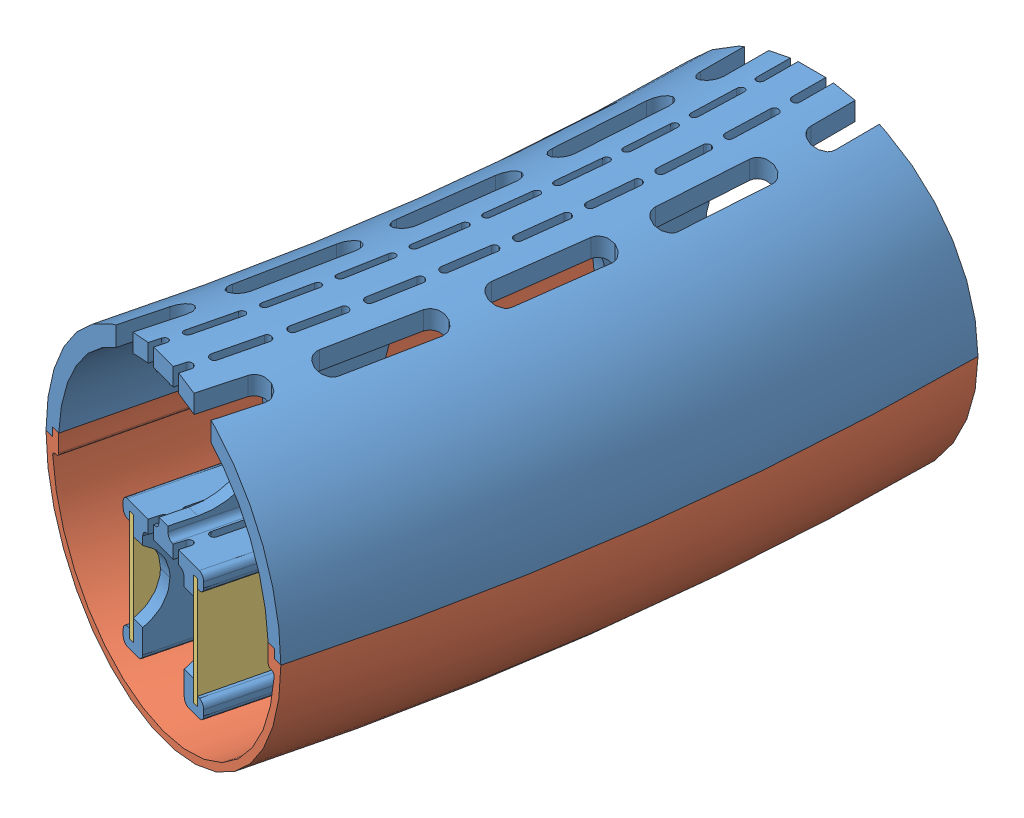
SolidWorks assembly big_15.SLDASM, configuration По умолчанию (file format 12000). Lengths in mm.
Overall size (36.3 30 56.86).
3 component instances, 3 part files, 6 mates.
Components (placement in the parent):
- big_frame-1: big_frame.SLDPRT [По умолчанию] at (-161.077 38.0168 -5.962) size (36.3 25.55 56.86)
- big_glass-1: big_glass.SLDPRT [По умолчанию] at (-161.077 38.0168 -5.962) size (36.3 15.78 55.65)
- big_led-1: big_led.SLDPRT [По умолчанию] at (-161.077 38.0168 -5.962) size (15.37 10 52.89)
Mates (geometry in assembly coordinates):
- Концентричный1: concentric aligned: circle of big_frame-1; circle of big_glass-1
- Совпадение1: coincident anti-aligned: plane of big_frame-1 through (18.4126 38.7937 42.1321) normal (0 -1 0); plane of big_glass-1 through (-161.077 38.7937 -5.962) normal (0 1 0)
- Совпадение2: coincident aligned: plane of big_frame-1 through (32.1082 38.0168 45.8018) normal (-0.258819 0 0.965926); plane of big_glass-1 through (-161.077 38.0168 -5.962) normal (-0.258819 0 0.965926)
- Концентричный2: concentric aligned: cylinder of big_frame-1 through (-161.077 82.127 -5.962) axis (0 1 0) radius 203.85; cylinder of big_led-1 through (-161.077 82.127 -5.962) axis (0 1 0) radius 203.85
- Совпадение3: coincident anti-aligned: plane of big_frame-1 through (36.3099 38.2668 46.9277) normal (0 -1 0); plane of big_led-1 through (-161.077 38.2668 -5.962) normal (0 1 0)
- Совпадение4: coincident aligned: plane of big_frame-1 through (17.6193 27.4668 41.9195) normal (-0.258819 0 0.965926); plane of big_led-1 through (-161.077 38.0168 -5.962) normal (-0.258819 0 0.965926)
